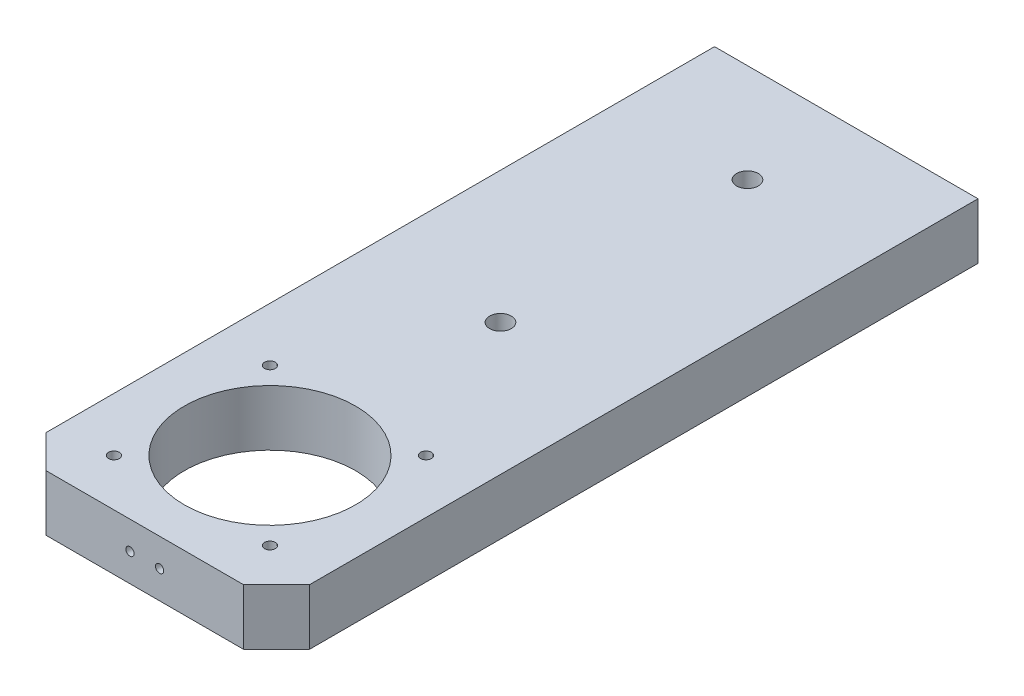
ISO-10303-21;
HEADER;
FILE_DESCRIPTION(('STEP AP214'),'2;1');
FILE_NAME('part.step','',(''),(''),'','','');
FILE_SCHEMA(('AUTOMOTIVE_DESIGN { 1 0 10303 214 1 1 1 1 }'));
ENDSEC;
DATA;
#1=APPLICATION_CONTEXT('core data for automotive mechanical design processes');
#2=APPLICATION_PROTOCOL_DEFINITION('international standard','automotive_design',2000,#1);
#3=PRODUCT_CONTEXT('',#1,'mechanical');
#4=PRODUCT('Part','Part','',(#3));
#5=PRODUCT_RELATED_PRODUCT_CATEGORY('part','',(#4));
#6=PRODUCT_DEFINITION_FORMATION('','',#4);
#7=PRODUCT_DEFINITION_CONTEXT('part definition',#1,'design');
#8=PRODUCT_DEFINITION('design','',#6,#7);
#9=PRODUCT_DEFINITION_SHAPE('','',#8);
#10=(LENGTH_UNIT() NAMED_UNIT(*) SI_UNIT(.MILLI.,.METRE.));
#11=(NAMED_UNIT(*) PLANE_ANGLE_UNIT() SI_UNIT($,.RADIAN.));
#12=(NAMED_UNIT(*) SI_UNIT($,.STERADIAN.) SOLID_ANGLE_UNIT());
#13=UNCERTAINTY_MEASURE_WITH_UNIT(LENGTH_MEASURE(1.E-05),#10,'distance_accuracy_value','');
#14=(GEOMETRIC_REPRESENTATION_CONTEXT(3) GLOBAL_UNCERTAINTY_ASSIGNED_CONTEXT((#13)) GLOBAL_UNIT_ASSIGNED_CONTEXT((#10,
#11,#12)) REPRESENTATION_CONTEXT('',''));
#15=CARTESIAN_POINT('',(0.,0.,0.));
#16=DIRECTION('',(0.,0.,1.));
#17=DIRECTION('',(1.,0.,0.));
#18=AXIS2_PLACEMENT_3D('',#15,#16,#17);
#19=CARTESIAN_POINT('',(-40.,-40.,213.));
#20=DIRECTION('',(1.,0.,0.));
#21=DIRECTION('',(0.,0.,-1.));
#22=AXIS2_PLACEMENT_3D('',#19,#20,#21);
#23=PLANE('',#22);
#24=DIRECTION('',(0.,0.,-1.));
#25=VECTOR('',#24,1.);
#26=CARTESIAN_POINT('',(-40.,-40.,213.));
#27=LINE('',#26,#25);
#28=CARTESIAN_POINT('',(-40.,-40.,203.));
#29=VERTEX_POINT('',#28);
#30=CARTESIAN_POINT('',(-40.,-40.,0.));
#31=VERTEX_POINT('',#30);
#32=EDGE_CURVE('E142',#29,#31,#27,.T.);
#33=ORIENTED_EDGE('',*,*,#32,.F.);
#34=DIRECTION('',(0.,1.,0.));
#35=VECTOR('',#34,1.);
#36=CARTESIAN_POINT('',(-40.,-40.,203.));
#37=LINE('',#36,#35);
#38=CARTESIAN_POINT('',(-40.,-23.,203.));
#39=VERTEX_POINT('',#38);
#40=EDGE_CURVE('E46',#29,#39,#37,.T.);
#41=ORIENTED_EDGE('',*,*,#40,.T.);
#42=DIRECTION('',(0.,0.,-1.));
#43=VECTOR('',#42,1.);
#44=CARTESIAN_POINT('',(-40.,-23.,213.));
#45=LINE('',#44,#43);
#46=CARTESIAN_POINT('',(-40.,-23.,0.));
#47=VERTEX_POINT('',#46);
#48=EDGE_CURVE('E126',#39,#47,#45,.T.);
#49=ORIENTED_EDGE('',*,*,#48,.T.);
#50=DIRECTION('',(0.,-1.,0.));
#51=VECTOR('',#50,1.);
#52=CARTESIAN_POINT('',(-40.,-40.,0.));
#53=LINE('',#52,#51);
#54=EDGE_CURVE('E116',#47,#31,#53,.T.);
#55=ORIENTED_EDGE('',*,*,#54,.T.);
#56=EDGE_LOOP('',(#33,#41,#49,#55));
#57=FACE_BOUND('',#56,.T.);
#58=ADVANCED_FACE('F16',(#57),#23,.F.);
#59=CARTESIAN_POINT('',(-40.,-40.,213.));
#60=DIRECTION('',(0.,1.,0.));
#61=DIRECTION('',(0.,0.,1.));
#62=AXIS2_PLACEMENT_3D('',#59,#60,#61);
#63=PLANE('',#62);
#64=CARTESIAN_POINT('',(0.,-40.,30.));
#65=DIRECTION('',(0.,-1.,0.));
#66=DIRECTION('',(0.,0.,-1.));
#67=AXIS2_PLACEMENT_3D('',#64,#65,#66);
#68=CIRCLE('',#67,5.525);
#69=CARTESIAN_POINT('',(0.,-40.,24.475));
#70=VERTEX_POINT('',#69);
#71=EDGE_CURVE('E162',#70,#70,#68,.T.);
#72=ORIENTED_EDGE('',*,*,#71,.F.);
#73=EDGE_LOOP('',(#72));
#74=FACE_BOUND('',#73,.T.);
#75=CARTESIAN_POINT('',(0.,-40.,105.));
#76=DIRECTION('',(0.,-1.,0.));
#77=DIRECTION('',(0.,0.,-1.));
#78=AXIS2_PLACEMENT_3D('',#75,#76,#77);
#79=CIRCLE('',#78,5.525);
#80=CARTESIAN_POINT('',(0.,-40.,99.475));
#81=VERTEX_POINT('',#80);
#82=EDGE_CURVE('E517',#81,#81,#79,.T.);
#83=ORIENTED_EDGE('',*,*,#82,.F.);
#84=EDGE_LOOP('',(#83));
#85=FACE_BOUND('',#84,.T.);
#86=CARTESIAN_POINT('',(-23.6880771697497,-40.,151.311922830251));
#87=DIRECTION('',(0.,1.,0.));
#88=DIRECTION('',(0.,0.,1.));
#89=AXIS2_PLACEMENT_3D('',#86,#87,#88);
#90=CIRCLE('',#89,1.65);
#91=CARTESIAN_POINT('',(-23.6880771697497,-40.,152.961922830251));
#92=VERTEX_POINT('',#91);
#93=EDGE_CURVE('E538',#92,#92,#90,.T.);
#94=ORIENTED_EDGE('',*,*,#93,.T.);
#95=EDGE_LOOP('',(#94));
#96=FACE_BOUND('',#95,.T.);
#97=CARTESIAN_POINT('',(23.6880771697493,-40.,151.31192283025));
#98=DIRECTION('',(0.,1.,0.));
#99=DIRECTION('',(0.,0.,1.));
#100=AXIS2_PLACEMENT_3D('',#97,#98,#99);
#101=CIRCLE('',#100,1.65);
#102=CARTESIAN_POINT('',(23.6880771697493,-40.,152.961922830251));
#103=VERTEX_POINT('',#102);
#104=EDGE_CURVE('E544',#103,#103,#101,.T.);
#105=ORIENTED_EDGE('',*,*,#104,.T.);
#106=EDGE_LOOP('',(#105));
#107=FACE_BOUND('',#106,.T.);
#108=CARTESIAN_POINT('',(23.6880771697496,-40.,198.688077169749));
#109=DIRECTION('',(0.,1.,0.));
#110=DIRECTION('',(0.,0.,1.));
#111=AXIS2_PLACEMENT_3D('',#108,#109,#110);
#112=CIRCLE('',#111,1.65);
#113=CARTESIAN_POINT('',(23.6880771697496,-40.,200.338077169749));
#114=VERTEX_POINT('',#113);
#115=EDGE_CURVE('E550',#114,#114,#112,.T.);
#116=ORIENTED_EDGE('',*,*,#115,.T.);
#117=EDGE_LOOP('',(#116));
#118=FACE_BOUND('',#117,.T.);
#119=CARTESIAN_POINT('',(-23.6880771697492,-40.,198.68807716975));
#120=DIRECTION('',(0.,1.,0.));
#121=DIRECTION('',(0.,0.,1.));
#122=AXIS2_PLACEMENT_3D('',#119,#120,#121);
#123=CIRCLE('',#122,1.65);
#124=CARTESIAN_POINT('',(-23.6880771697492,-40.,200.33807716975));
#125=VERTEX_POINT('',#124);
#126=EDGE_CURVE('E100',#125,#125,#123,.T.);
#127=ORIENTED_EDGE('',*,*,#126,.T.);
#128=EDGE_LOOP('',(#127));
#129=FACE_BOUND('',#128,.T.);
#130=CARTESIAN_POINT('',(0.,-40.,175.));
#131=DIRECTION('',(0.,-1.,0.));
#132=DIRECTION('',(0.,0.,-1.));
#133=AXIS2_PLACEMENT_3D('',#130,#131,#132);
#134=CIRCLE('',#133,26.);
#135=CARTESIAN_POINT('',(0.,-40.,149.));
#136=VERTEX_POINT('',#135);
#137=EDGE_CURVE('E112',#136,#136,#134,.T.);
#138=ORIENTED_EDGE('',*,*,#137,.F.);
#139=EDGE_LOOP('',(#138));
#140=FACE_BOUND('',#139,.T.);
#141=DIRECTION('',(1.,0.,0.));
#142=VECTOR('',#141,1.);
#143=CARTESIAN_POINT('',(-40.,-40.,213.));
#144=LINE('',#143,#142);
#145=CARTESIAN_POINT('',(-30.,-40.,213.));
#146=VERTEX_POINT('',#145);
#147=CARTESIAN_POINT('',(30.,-40.,213.));
#148=VERTEX_POINT('',#147);
#149=EDGE_CURVE('E119',#146,#148,#144,.T.);
#150=ORIENTED_EDGE('',*,*,#149,.F.);
#151=DIRECTION('',(0.707106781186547,0.,0.707106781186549));
#152=VECTOR('',#151,1.);
#153=CARTESIAN_POINT('',(-30.,-40.,213.));
#154=LINE('',#153,#152);
#155=EDGE_CURVE('E152',#146,#29,#154,.F.);
#156=ORIENTED_EDGE('',*,*,#155,.T.);
#157=ORIENTED_EDGE('',*,*,#32,.T.);
#158=DIRECTION('',(1.,0.,0.));
#159=VECTOR('',#158,1.);
#160=CARTESIAN_POINT('',(-40.,-40.,0.));
#161=LINE('',#160,#159);
#162=CARTESIAN_POINT('',(40.,-40.,0.));
#163=VERTEX_POINT('',#162);
#164=EDGE_CURVE('E129',#31,#163,#161,.T.);
#165=ORIENTED_EDGE('',*,*,#164,.T.);
#166=DIRECTION('',(0.,0.,-1.));
#167=VECTOR('',#166,1.);
#168=CARTESIAN_POINT('',(40.,-40.,213.));
#169=LINE('',#168,#167);
#170=CARTESIAN_POINT('',(40.,-40.,203.));
#171=VERTEX_POINT('',#170);
#172=EDGE_CURVE('E140',#171,#163,#169,.T.);
#173=ORIENTED_EDGE('',*,*,#172,.F.);
#174=DIRECTION('',(0.707106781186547,0.,-0.707106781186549));
#175=VECTOR('',#174,1.);
#176=CARTESIAN_POINT('',(30.,-40.,213.));
#177=LINE('',#176,#175);
#178=EDGE_CURVE('E150',#171,#148,#177,.F.);
#179=ORIENTED_EDGE('',*,*,#178,.T.);
#180=EDGE_LOOP('',(#150,#156,#157,#165,#173,#179));
#181=FACE_BOUND('',#180,.T.);
#182=ADVANCED_FACE('F256',(#74,#85,#96,#107,#118,#129,#140,#181),#63,.F.);
#183=CARTESIAN_POINT('',(40.,-40.,213.));
#184=DIRECTION('',(-1.,0.,0.));
#185=DIRECTION('',(0.,0.,1.));
#186=AXIS2_PLACEMENT_3D('',#183,#184,#185);
#187=PLANE('',#186);
#188=DIRECTION('',(0.,0.,-1.));
#189=VECTOR('',#188,1.);
#190=CARTESIAN_POINT('',(40.,-23.,213.));
#191=LINE('',#190,#189);
#192=CARTESIAN_POINT('',(40.,-23.,203.));
#193=VERTEX_POINT('',#192);
#194=CARTESIAN_POINT('',(40.,-23.,0.));
#195=VERTEX_POINT('',#194);
#196=EDGE_CURVE('E138',#193,#195,#191,.T.);
#197=ORIENTED_EDGE('',*,*,#196,.F.);
#198=DIRECTION('',(0.,-1.,0.));
#199=VECTOR('',#198,1.);
#200=CARTESIAN_POINT('',(40.,-40.,203.));
#201=LINE('',#200,#199);
#202=EDGE_CURVE('E11',#193,#171,#201,.T.);
#203=ORIENTED_EDGE('',*,*,#202,.T.);
#204=ORIENTED_EDGE('',*,*,#172,.T.);
#205=DIRECTION('',(0.,1.,0.));
#206=VECTOR('',#205,1.);
#207=CARTESIAN_POINT('',(40.,-40.,0.));
#208=LINE('',#207,#206);
#209=EDGE_CURVE('E132',#163,#195,#208,.T.);
#210=ORIENTED_EDGE('',*,*,#209,.T.);
#211=EDGE_LOOP('',(#197,#203,#204,#210));
#212=FACE_BOUND('',#211,.T.);
#213=ADVANCED_FACE('F262',(#212),#187,.F.);
#214=CARTESIAN_POINT('',(-40.,-23.,213.));
#215=DIRECTION('',(0.,-1.,0.));
#216=DIRECTION('',(0.,0.,-1.));
#217=AXIS2_PLACEMENT_3D('',#214,#215,#216);
#218=PLANE('',#217);
#219=CARTESIAN_POINT('',(0.,-23.,30.));
#220=DIRECTION('',(0.,-1.,0.));
#221=DIRECTION('',(0.,0.,-1.));
#222=AXIS2_PLACEMENT_3D('',#219,#220,#221);
#223=CIRCLE('',#222,3.3);
#224=CARTESIAN_POINT('',(0.,-23.,26.7));
#225=VERTEX_POINT('',#224);
#226=EDGE_CURVE('E514',#225,#225,#223,.T.);
#227=ORIENTED_EDGE('',*,*,#226,.T.);
#228=EDGE_LOOP('',(#227));
#229=FACE_BOUND('',#228,.T.);
#230=CARTESIAN_POINT('',(0.,-23.,105.));
#231=DIRECTION('',(0.,-1.,0.));
#232=DIRECTION('',(0.,0.,-1.));
#233=AXIS2_PLACEMENT_3D('',#230,#231,#232);
#234=CIRCLE('',#233,3.3);
#235=CARTESIAN_POINT('',(0.,-23.,101.7));
#236=VERTEX_POINT('',#235);
#237=EDGE_CURVE('E532',#236,#236,#234,.T.);
#238=ORIENTED_EDGE('',*,*,#237,.T.);
#239=EDGE_LOOP('',(#238));
#240=FACE_BOUND('',#239,.T.);
#241=CARTESIAN_POINT('',(-23.6880771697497,-23.,151.311922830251));
#242=DIRECTION('',(0.,1.,0.));
#243=DIRECTION('',(0.,0.,1.));
#244=AXIS2_PLACEMENT_3D('',#241,#242,#243);
#245=CIRCLE('',#244,1.65);
#246=CARTESIAN_POINT('',(-23.6880771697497,-23.,152.961922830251));
#247=VERTEX_POINT('',#246);
#248=EDGE_CURVE('E535',#247,#247,#245,.T.);
#249=ORIENTED_EDGE('',*,*,#248,.F.);
#250=EDGE_LOOP('',(#249));
#251=FACE_BOUND('',#250,.T.);
#252=CARTESIAN_POINT('',(23.6880771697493,-23.,151.31192283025));
#253=DIRECTION('',(0.,1.,0.));
#254=DIRECTION('',(0.,0.,1.));
#255=AXIS2_PLACEMENT_3D('',#252,#253,#254);
#256=CIRCLE('',#255,1.65);
#257=CARTESIAN_POINT('',(23.6880771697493,-23.,152.961922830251));
#258=VERTEX_POINT('',#257);
#259=EDGE_CURVE('E541',#258,#258,#256,.T.);
#260=ORIENTED_EDGE('',*,*,#259,.F.);
#261=EDGE_LOOP('',(#260));
#262=FACE_BOUND('',#261,.T.);
#263=CARTESIAN_POINT('',(23.6880771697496,-23.,198.688077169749));
#264=DIRECTION('',(0.,1.,0.));
#265=DIRECTION('',(0.,0.,1.));
#266=AXIS2_PLACEMENT_3D('',#263,#264,#265);
#267=CIRCLE('',#266,1.65);
#268=CARTESIAN_POINT('',(23.6880771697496,-23.,200.338077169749));
#269=VERTEX_POINT('',#268);
#270=EDGE_CURVE('E547',#269,#269,#267,.T.);
#271=ORIENTED_EDGE('',*,*,#270,.F.);
#272=EDGE_LOOP('',(#271));
#273=FACE_BOUND('',#272,.T.);
#274=CARTESIAN_POINT('',(-23.6880771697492,-23.,198.68807716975));
#275=DIRECTION('',(0.,1.,0.));
#276=DIRECTION('',(0.,0.,1.));
#277=AXIS2_PLACEMENT_3D('',#274,#275,#276);
#278=CIRCLE('',#277,1.65);
#279=CARTESIAN_POINT('',(-23.6880771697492,-23.,200.33807716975));
#280=VERTEX_POINT('',#279);
#281=EDGE_CURVE('E553',#280,#280,#278,.T.);
#282=ORIENTED_EDGE('',*,*,#281,.F.);
#283=EDGE_LOOP('',(#282));
#284=FACE_BOUND('',#283,.T.);
#285=CARTESIAN_POINT('',(0.,-23.,175.));
#286=DIRECTION('',(0.,-1.,0.));
#287=DIRECTION('',(0.,0.,-1.));
#288=AXIS2_PLACEMENT_3D('',#285,#286,#287);
#289=CIRCLE('',#288,26.);
#290=CARTESIAN_POINT('',(0.,-23.,149.));
#291=VERTEX_POINT('',#290);
#292=EDGE_CURVE('E113',#291,#291,#289,.T.);
#293=ORIENTED_EDGE('',*,*,#292,.T.);
#294=EDGE_LOOP('',(#293));
#295=FACE_BOUND('',#294,.T.);
#296=ORIENTED_EDGE('',*,*,#48,.F.);
#297=DIRECTION('',(-0.707106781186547,0.,-0.707106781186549));
#298=VECTOR('',#297,1.);
#299=CARTESIAN_POINT('',(-30.,-23.,213.));
#300=LINE('',#299,#298);
#301=CARTESIAN_POINT('',(-30.,-23.,213.));
#302=VERTEX_POINT('',#301);
#303=EDGE_CURVE('E30',#39,#302,#300,.F.);
#304=ORIENTED_EDGE('',*,*,#303,.T.);
#305=DIRECTION('',(-1.,0.,0.));
#306=VECTOR('',#305,1.);
#307=CARTESIAN_POINT('',(-40.,-23.,213.));
#308=LINE('',#307,#306);
#309=CARTESIAN_POINT('',(30.,-23.,213.));
#310=VERTEX_POINT('',#309);
#311=EDGE_CURVE('E122',#310,#302,#308,.T.);
#312=ORIENTED_EDGE('',*,*,#311,.F.);
#313=DIRECTION('',(-0.707106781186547,0.,0.707106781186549));
#314=VECTOR('',#313,1.);
#315=CARTESIAN_POINT('',(30.,-23.,213.));
#316=LINE('',#315,#314);
#317=EDGE_CURVE('E38',#310,#193,#316,.F.);
#318=ORIENTED_EDGE('',*,*,#317,.T.);
#319=ORIENTED_EDGE('',*,*,#196,.T.);
#320=DIRECTION('',(-1.,0.,0.));
#321=VECTOR('',#320,1.);
#322=CARTESIAN_POINT('',(-40.,-23.,0.));
#323=LINE('',#322,#321);
#324=EDGE_CURVE('E123',#195,#47,#323,.T.);
#325=ORIENTED_EDGE('',*,*,#324,.T.);
#326=EDGE_LOOP('',(#296,#304,#312,#318,#319,#325));
#327=FACE_BOUND('',#326,.T.);
#328=ADVANCED_FACE('F276',(#229,#240,#251,#262,#273,#284,#295,#327),#218,.F.);
#329=CARTESIAN_POINT('',(0.,0.,213.));
#330=DIRECTION('',(0.,0.,-1.));
#331=DIRECTION('',(-1.,0.,0.));
#332=AXIS2_PLACEMENT_3D('',#329,#330,#331);
#333=PLANE('',#332);
#334=CARTESIAN_POINT('',(-4.5,-31.5,213.));
#335=DIRECTION('',(0.,0.,1.));
#336=DIRECTION('',(1.,0.,0.));
#337=AXIS2_PLACEMENT_3D('',#334,#335,#336);
#338=CIRCLE('',#337,1.25);
#339=CARTESIAN_POINT('',(-3.25,-31.5,213.));
#340=VERTEX_POINT('',#339);
#341=EDGE_CURVE('E493',#340,#340,#338,.T.);
#342=ORIENTED_EDGE('',*,*,#341,.F.);
#343=EDGE_LOOP('',(#342));
#344=FACE_BOUND('',#343,.T.);
#345=CARTESIAN_POINT('',(4.5,-31.5,213.));
#346=DIRECTION('',(0.,0.,1.));
#347=DIRECTION('',(1.,0.,0.));
#348=AXIS2_PLACEMENT_3D('',#345,#346,#347);
#349=CIRCLE('',#348,1.25);
#350=CARTESIAN_POINT('',(5.75,-31.5,213.));
#351=VERTEX_POINT('',#350);
#352=EDGE_CURVE('E163',#351,#351,#349,.T.);
#353=ORIENTED_EDGE('',*,*,#352,.F.);
#354=EDGE_LOOP('',(#353));
#355=FACE_BOUND('',#354,.T.);
#356=ORIENTED_EDGE('',*,*,#311,.T.);
#357=DIRECTION('',(0.,-1.,0.));
#358=VECTOR('',#357,1.);
#359=CARTESIAN_POINT('',(-30.,0.,213.));
#360=LINE('',#359,#358);
#361=EDGE_CURVE('E147',#302,#146,#360,.T.);
#362=ORIENTED_EDGE('',*,*,#361,.T.);
#363=ORIENTED_EDGE('',*,*,#149,.T.);
#364=DIRECTION('',(0.,1.,0.));
#365=VECTOR('',#364,1.);
#366=CARTESIAN_POINT('',(30.,0.,213.));
#367=LINE('',#366,#365);
#368=EDGE_CURVE('E144',#148,#310,#367,.T.);
#369=ORIENTED_EDGE('',*,*,#368,.T.);
#370=EDGE_LOOP('',(#356,#362,#363,#369));
#371=FACE_BOUND('',#370,.T.);
#372=ADVANCED_FACE('F278',(#344,#355,#371),#333,.F.);
#373=CARTESIAN_POINT('',(0.,0.,0.));
#374=DIRECTION('',(0.,0.,-1.));
#375=DIRECTION('',(-1.,0.,0.));
#376=AXIS2_PLACEMENT_3D('',#373,#374,#375);
#377=PLANE('',#376);
#378=CARTESIAN_POINT('',(25.,-32.,0.));
#379=DIRECTION('',(0.,0.,-1.));
#380=DIRECTION('',(-1.,0.,0.));
#381=AXIS2_PLACEMENT_3D('',#378,#379,#380);
#382=CIRCLE('',#381,2.5);
#383=CARTESIAN_POINT('',(22.5,-32.,0.));
#384=VERTEX_POINT('',#383);
#385=EDGE_CURVE('E94',#384,#384,#382,.T.);
#386=ORIENTED_EDGE('',*,*,#385,.F.);
#387=EDGE_LOOP('',(#386));
#388=FACE_BOUND('',#387,.T.);
#389=CARTESIAN_POINT('',(0.,-32.,0.));
#390=DIRECTION('',(0.,0.,-1.));
#391=DIRECTION('',(-1.,0.,0.));
#392=AXIS2_PLACEMENT_3D('',#389,#390,#391);
#393=CIRCLE('',#392,2.5);
#394=CARTESIAN_POINT('',(-2.5,-32.,0.));
#395=VERTEX_POINT('',#394);
#396=EDGE_CURVE('E93',#395,#395,#393,.T.);
#397=ORIENTED_EDGE('',*,*,#396,.F.);
#398=EDGE_LOOP('',(#397));
#399=FACE_BOUND('',#398,.T.);
#400=CARTESIAN_POINT('',(-25.,-32.,0.));
#401=DIRECTION('',(0.,0.,-1.));
#402=DIRECTION('',(-1.,0.,0.));
#403=AXIS2_PLACEMENT_3D('',#400,#401,#402);
#404=CIRCLE('',#403,2.5);
#405=CARTESIAN_POINT('',(-27.5,-32.,0.));
#406=VERTEX_POINT('',#405);
#407=EDGE_CURVE('E106',#406,#406,#404,.T.);
#408=ORIENTED_EDGE('',*,*,#407,.F.);
#409=EDGE_LOOP('',(#408));
#410=FACE_BOUND('',#409,.T.);
#411=ORIENTED_EDGE('',*,*,#54,.F.);
#412=ORIENTED_EDGE('',*,*,#324,.F.);
#413=ORIENTED_EDGE('',*,*,#209,.F.);
#414=ORIENTED_EDGE('',*,*,#164,.F.);
#415=EDGE_LOOP('',(#411,#412,#413,#414));
#416=FACE_BOUND('',#415,.T.);
#417=ADVANCED_FACE('F272',(#388,#399,#410,#416),#377,.T.);
#418=CARTESIAN_POINT('',(0.,-23.,175.));
#419=DIRECTION('',(0.,-1.,0.));
#420=DIRECTION('',(0.,0.,-1.));
#421=AXIS2_PLACEMENT_3D('',#418,#419,#420);
#422=CYLINDRICAL_SURFACE('',#421,26.);
#423=CARTESIAN_POINT('',(-3.25,-31.5,200.79607528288));
#424=CARTESIAN_POINT('',(-3.25000312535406,-31.4302395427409,200.79607514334));
#425=CARTESIAN_POINT('',(-3.25586006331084,-31.3604292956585,200.795339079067));
#426=CARTESIAN_POINT('',(-3.27913481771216,-31.2227376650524,200.792390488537));
#427=CARTESIAN_POINT('',(-3.29656629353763,-31.1548586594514,200.790176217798));
#428=CARTESIAN_POINT('',(-3.34246714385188,-31.0230483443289,200.78426740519));
#429=CARTESIAN_POINT('',(-3.37093007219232,-30.9591147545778,200.780573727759));
#430=CARTESIAN_POINT('',(-3.43804252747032,-30.836975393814,200.771709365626));
#431=CARTESIAN_POINT('',(-3.47668961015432,-30.7787682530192,200.766539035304));
#432=CARTESIAN_POINT('',(-3.5631499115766,-30.6695323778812,200.7547251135));
#433=CARTESIAN_POINT('',(-3.61098722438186,-30.618523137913,200.74807764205));
#434=CARTESIAN_POINT('',(-3.71436053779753,-30.5252603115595,200.733368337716));
#435=CARTESIAN_POINT('',(-3.76989704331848,-30.4830072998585,200.725306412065));
#436=CARTESIAN_POINT('',(-3.88750305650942,-30.4081006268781,200.707797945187));
#437=CARTESIAN_POINT('',(-3.94961840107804,-30.3755212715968,200.698341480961));
#438=CARTESIAN_POINT('',(-4.07824846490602,-30.3212294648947,200.678242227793));
#439=CARTESIAN_POINT('',(-4.14476342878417,-30.2995176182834,200.667599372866));
#440=CARTESIAN_POINT('',(-4.28109915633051,-30.2673019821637,200.645214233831));
#441=CARTESIAN_POINT('',(-4.35094900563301,-30.2569290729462,200.63346077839));
#442=CARTESIAN_POINT('',(-4.49127734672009,-30.2480543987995,200.609246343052));
#443=CARTESIAN_POINT('',(-4.5617558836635,-30.2495534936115,200.596785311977));
#444=CARTESIAN_POINT('',(-4.7022394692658,-30.2644241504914,200.571353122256));
#445=CARTESIAN_POINT('',(-4.77222871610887,-30.2779378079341,200.558377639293));
#446=CARTESIAN_POINT('',(-4.90891344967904,-30.3166421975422,200.532477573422));
#447=CARTESIAN_POINT('',(-4.97560875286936,-30.3418335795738,200.519552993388));
#448=CARTESIAN_POINT('',(-5.1041879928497,-30.4033850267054,200.494148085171));
#449=CARTESIAN_POINT('',(-5.16604379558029,-30.4398050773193,200.481670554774));
#450=CARTESIAN_POINT('',(-5.28275096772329,-30.5227961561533,200.457731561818));
#451=CARTESIAN_POINT('',(-5.33760249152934,-30.5693669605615,200.446270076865));
#452=CARTESIAN_POINT('',(-5.43825373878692,-30.6709924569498,200.424948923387));
#453=CARTESIAN_POINT('',(-5.48412221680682,-30.7259764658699,200.415077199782));
#454=CARTESIAN_POINT('',(-5.56592287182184,-30.8431793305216,200.397288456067));
#455=CARTESIAN_POINT('',(-5.60185623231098,-30.9053973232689,200.389371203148));
#456=CARTESIAN_POINT('',(-5.66199421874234,-31.0339503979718,200.376027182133));
#457=CARTESIAN_POINT('',(-5.68642322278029,-31.1001755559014,200.370552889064));
#458=CARTESIAN_POINT('',(-5.72381683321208,-31.2359397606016,200.362142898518));
#459=CARTESIAN_POINT('',(-5.73678303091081,-31.3054783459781,200.359206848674));
#460=CARTESIAN_POINT('',(-5.75066799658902,-31.4443427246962,200.356061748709));
#461=CARTESIAN_POINT('',(-5.75183171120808,-31.5136428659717,200.355797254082));
#462=CARTESIAN_POINT('',(-5.74271164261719,-31.6514433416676,200.357864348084));
#463=CARTESIAN_POINT('',(-5.7324285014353,-31.719943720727,200.360195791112));
#464=CARTESIAN_POINT('',(-5.7008580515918,-31.8537432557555,200.367311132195));
#465=CARTESIAN_POINT('',(-5.67964360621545,-31.9190605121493,200.372078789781));
#466=CARTESIAN_POINT('',(-5.62692015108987,-32.0451820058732,200.383823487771));
#467=CARTESIAN_POINT('',(-5.595410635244,-32.1059860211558,200.390800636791));
#468=CARTESIAN_POINT('',(-5.52260587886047,-32.2221731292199,200.406735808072));
#469=CARTESIAN_POINT('',(-5.48119672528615,-32.2774816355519,200.415716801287));
#470=CARTESIAN_POINT('',(-5.39001599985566,-32.380397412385,200.435209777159));
#471=CARTESIAN_POINT('',(-5.34024349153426,-32.4280038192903,200.445721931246));
#472=CARTESIAN_POINT('',(-5.23254631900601,-32.5152754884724,200.468088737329));
#473=CARTESIAN_POINT('',(-5.17446618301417,-32.5547426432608,200.479967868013));
#474=CARTESIAN_POINT('',(-5.05263941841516,-32.6233785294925,200.504405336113));
#475=CARTESIAN_POINT('',(-4.98889220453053,-32.6525461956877,200.51696374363));
#476=CARTESIAN_POINT('',(-4.856291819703,-32.7002533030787,200.542534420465));
#477=CARTESIAN_POINT('',(-4.78736794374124,-32.7185942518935,200.555550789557));
#478=CARTESIAN_POINT('',(-4.64736838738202,-32.7433164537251,200.581380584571));
#479=CARTESIAN_POINT('',(-4.57629261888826,-32.7496972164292,200.594194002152));
#480=CARTESIAN_POINT('',(-4.43365989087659,-32.7502829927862,200.619288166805));
#481=CARTESIAN_POINT('',(-4.36210221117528,-32.7444326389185,200.631566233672));
#482=CARTESIAN_POINT('',(-4.22089191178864,-32.7205432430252,200.655198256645));
#483=CARTESIAN_POINT('',(-4.15123923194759,-32.702504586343,200.666552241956));
#484=CARTESIAN_POINT('',(-4.01641204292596,-32.6548659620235,200.687994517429));
#485=CARTESIAN_POINT('',(-3.95120728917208,-32.6253557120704,200.698091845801));
#486=CARTESIAN_POINT('',(-3.82663995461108,-32.5555483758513,200.716936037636));
#487=CARTESIAN_POINT('',(-3.76727676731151,-32.5152524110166,200.725683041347));
#488=CARTESIAN_POINT('',(-3.65689208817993,-32.4255610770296,200.74160479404));
#489=CARTESIAN_POINT('',(-3.60577510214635,-32.376286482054,200.7487979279));
#490=CARTESIAN_POINT('',(-3.51252072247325,-32.2696750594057,200.761685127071));
#491=CARTESIAN_POINT('',(-3.47038501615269,-32.2123367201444,200.767378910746));
#492=CARTESIAN_POINT('',(-3.39677004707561,-32.0918768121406,200.777186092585));
#493=CARTESIAN_POINT('',(-3.36518693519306,-32.0288198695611,200.781314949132));
#494=CARTESIAN_POINT('',(-3.3130706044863,-31.8982788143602,200.788064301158));
#495=CARTESIAN_POINT('',(-3.29252379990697,-31.8308002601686,200.790686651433));
#496=CARTESIAN_POINT('',(-3.26855786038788,-31.7190722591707,200.7937319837));
#497=CARTESIAN_POINT('',(-3.26160784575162,-31.6755604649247,200.794610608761));
#498=CARTESIAN_POINT('',(-3.25232793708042,-31.5880390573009,200.795782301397));
#499=CARTESIAN_POINT('',(-3.24999802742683,-31.5440294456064,200.796075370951));
#500=CARTESIAN_POINT('',(-3.25,-31.5,200.79607528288));
#501=B_SPLINE_CURVE_WITH_KNOTS('',3,(#423,#424,#425,#426,#427,#428,#429,#430,#431,#432,#433,
#434,#435,#436,#437,#438,#439,#440,#441,#442,#443,#444,#445,#446,#447,#448,#449,#450,#451,#452,
#453,#454,#455,#456,#457,#458,#459,#460,#461,#462,#463,#464,#465,#466,#467,#468,#469,#470,#471,
#472,#473,#474,#475,#476,#477,#478,#479,#480,#481,#482,#483,#484,#485,#486,#487,#488,#489,#490,
#491,#492,#493,#494,#495,#496,#497,#498,#499,#500),.UNSPECIFIED.,.T.,.F.,(4,2,2,2,2,2,2,2,2,2,2,
2,2,2,2,2,2,2,2,2,2,2,2,2,2,2,2,2,2,2,2,2,2,2,2,2,2,2,4),(0.,0.209120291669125,0.41848781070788,
0.627733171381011,0.836928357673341,1.04667966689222,1.25644473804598,1.46778169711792,
1.67913041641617,1.89289368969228,2.10667244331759,2.3230136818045,2.53936696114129,
2.75689667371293,2.97442159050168,3.19021028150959,3.40597325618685,3.61733327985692,
3.82866395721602,4.035599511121,4.24252345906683,4.4480856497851,4.65365794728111,
4.86172038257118,5.0698061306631,5.28247724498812,5.49517034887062,5.71165063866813,
5.92813980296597,6.14561108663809,6.36307549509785,6.57887229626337,6.79464666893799,
7.00770816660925,7.22080965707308,7.43174757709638,7.64242523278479,7.77441234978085,
7.90639902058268),.UNSPECIFIED.);
#502=CARTESIAN_POINT('',(-3.25,-31.5,200.79607528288));
#503=VERTEX_POINT('',#502);
#504=EDGE_CURVE('E20',#503,#503,#501,.T.);
#505=ORIENTED_EDGE('',*,*,#504,.T.);
#506=EDGE_LOOP('',(#505));
#507=FACE_BOUND('',#506,.T.);
#508=CARTESIAN_POINT('',(5.75,-31.5,200.356212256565));
#509=CARTESIAN_POINT('',(5.74999674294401,-31.430995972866,200.356213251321));
#510=CARTESIAN_POINT('',(5.74426456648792,-31.3619420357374,200.357514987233));
#511=CARTESIAN_POINT('',(5.72150386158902,-31.2257642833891,200.362660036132));
#512=CARTESIAN_POINT('',(5.70446185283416,-31.1586428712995,200.366506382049));
#513=CARTESIAN_POINT('',(5.65964841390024,-31.0283487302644,200.376542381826));
#514=CARTESIAN_POINT('',(5.63188848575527,-30.9651718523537,200.382729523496));
#515=CARTESIAN_POINT('',(5.566507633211,-30.8444271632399,200.397147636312));
#516=CARTESIAN_POINT('',(5.52888848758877,-30.7868583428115,200.405378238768));
#517=CARTESIAN_POINT('',(5.4443822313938,-30.6781487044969,200.423622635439));
#518=CARTESIAN_POINT('',(5.39738726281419,-30.6270952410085,200.433657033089));
#519=CARTESIAN_POINT('',(5.29577656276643,-30.5335580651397,200.455008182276));
#520=CARTESIAN_POINT('',(5.24115974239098,-30.4910755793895,200.466325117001));
#521=CARTESIAN_POINT('',(5.12452177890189,-30.4149052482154,200.490054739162));
#522=CARTESIAN_POINT('',(5.06236305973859,-30.3814338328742,200.50248618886));
#523=CARTESIAN_POINT('',(4.93337578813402,-30.3254233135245,200.527751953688));
#524=CARTESIAN_POINT('',(4.86654681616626,-30.3028851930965,200.540586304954));
#525=CARTESIAN_POINT('',(4.72907114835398,-30.2691032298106,200.566400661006));
#526=CARTESIAN_POINT('',(4.65838364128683,-30.2580247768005,200.57938013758));
#527=CARTESIAN_POINT('',(4.51607212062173,-30.24806961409,200.604888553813));
#528=CARTESIAN_POINT('',(4.44444809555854,-30.2491930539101,200.617417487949));
#529=CARTESIAN_POINT('',(4.30228736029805,-30.2636686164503,200.641675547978));
#530=CARTESIAN_POINT('',(4.23175090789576,-30.277023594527,200.653404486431));
#531=CARTESIAN_POINT('',(4.09384050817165,-30.3156598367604,200.675773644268));
#532=CARTESIAN_POINT('',(4.02646641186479,-30.3409405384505,200.686413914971));
#533=CARTESIAN_POINT('',(3.89754288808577,-30.4024592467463,200.706290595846));
#534=CARTESIAN_POINT('',(3.83594177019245,-30.4385846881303,200.715540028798));
#535=CARTESIAN_POINT('',(3.71965465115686,-30.5209010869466,200.732617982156));
#536=CARTESIAN_POINT('',(3.66496818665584,-30.567091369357,200.740446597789));
#537=CARTESIAN_POINT('',(3.56480391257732,-30.6676058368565,200.754508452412));
#538=CARTESIAN_POINT('',(3.5192201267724,-30.7218218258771,200.76076030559));
#539=CARTESIAN_POINT('',(3.43779585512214,-30.8372700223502,200.771753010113));
#540=CARTESIAN_POINT('',(3.40195485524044,-30.8985018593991,200.776493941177));
#541=CARTESIAN_POINT('',(3.34139087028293,-31.0256208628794,200.784414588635));
#542=CARTESIAN_POINT('',(3.31656674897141,-31.0914589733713,200.787608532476));
#543=CARTESIAN_POINT('',(3.27829210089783,-31.2264149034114,200.792502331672));
#544=CARTESIAN_POINT('',(3.2648412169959,-31.2955326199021,200.794202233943));
#545=CARTESIAN_POINT('',(3.24975468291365,-31.4347145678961,200.796107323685));
#546=CARTESIAN_POINT('',(3.24806023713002,-31.5047723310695,200.79631994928));
#547=CARTESIAN_POINT('',(3.25638090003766,-31.6441771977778,200.79527089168));
#548=CARTESIAN_POINT('',(3.26639584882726,-31.7135243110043,200.794009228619));
#549=CARTESIAN_POINT('',(3.29781739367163,-31.8494524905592,200.790010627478));
#550=CARTESIAN_POINT('',(3.31920997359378,-31.9160368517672,200.787275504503));
#551=CARTESIAN_POINT('',(3.3727433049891,-32.0446505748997,200.780328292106));
#552=CARTESIAN_POINT('',(3.40488407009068,-32.1066799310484,200.776116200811));
#553=CARTESIAN_POINT('',(3.47904634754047,-32.2245787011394,200.766211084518));
#554=CARTESIAN_POINT('',(3.52108940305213,-32.2804342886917,200.760514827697));
#555=CARTESIAN_POINT('',(3.61377991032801,-32.3842841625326,200.747675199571));
#556=CARTESIAN_POINT('',(3.66442754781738,-32.4322782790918,200.740531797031));
#557=CARTESIAN_POINT('',(3.77318591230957,-32.5193744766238,200.72481485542));
#558=CARTESIAN_POINT('',(3.83134036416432,-32.5584204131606,200.716232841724));
#559=CARTESIAN_POINT('',(3.95318353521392,-32.6262117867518,200.69778458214));
#560=CARTESIAN_POINT('',(4.0168725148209,-32.6549567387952,200.687918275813));
#561=CARTESIAN_POINT('',(4.14865648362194,-32.7016634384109,200.666965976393));
#562=CARTESIAN_POINT('',(4.21679018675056,-32.7195107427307,200.655868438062));
#563=CARTESIAN_POINT('',(4.35493756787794,-32.7435326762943,200.63278024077));
#564=CARTESIAN_POINT('',(4.42495138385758,-32.7497064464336,200.620789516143));
#565=CARTESIAN_POINT('',(4.56579430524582,-32.7502765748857,200.596067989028));
#566=CARTESIAN_POINT('',(4.63662272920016,-32.7445256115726,200.583329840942));
#567=CARTESIAN_POINT('',(4.77625166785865,-32.721145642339,200.55763021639));
#568=CARTESIAN_POINT('',(4.84505204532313,-32.7035158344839,200.544668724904));
#569=CARTESIAN_POINT('',(4.97928781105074,-32.6566672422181,200.518844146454));
#570=CARTESIAN_POINT('',(5.04468972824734,-32.6273514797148,200.505982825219));
#571=CARTESIAN_POINT('',(5.16963377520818,-32.5579215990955,200.48095271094));
#572=CARTESIAN_POINT('',(5.22917606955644,-32.5178077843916,200.468783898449));
#573=CARTESIAN_POINT('',(5.34048096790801,-32.428002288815,200.445677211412));
#574=CARTESIAN_POINT('',(5.39226877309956,-32.378342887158,200.434735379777));
#575=CARTESIAN_POINT('',(5.48674312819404,-32.2706914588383,200.414523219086));
#576=CARTESIAN_POINT('',(5.52942822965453,-32.2126981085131,200.405253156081));
#577=CARTESIAN_POINT('',(5.60369417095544,-32.0910619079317,200.388974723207));
#578=CARTESIAN_POINT('',(5.63544895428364,-32.0275298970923,200.38193108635));
#579=CARTESIAN_POINT('',(5.68776724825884,-31.8958695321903,200.370258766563));
#580=CARTESIAN_POINT('',(5.70834620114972,-31.827747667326,200.365626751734));
#581=CARTESIAN_POINT('',(5.7319705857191,-31.715948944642,200.360295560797));
#582=CARTESIAN_POINT('',(5.73872187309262,-31.6730590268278,200.358767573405));
#583=CARTESIAN_POINT('',(5.74773757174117,-31.5867859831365,200.356725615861));
#584=CARTESIAN_POINT('',(5.75000204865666,-31.5434028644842,200.356211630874));
#585=CARTESIAN_POINT('',(5.75,-31.5,200.356212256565));
#586=B_SPLINE_CURVE_WITH_KNOTS('',3,(#508,#509,#510,#511,#512,#513,#514,#515,#516,#517,#518,
#519,#520,#521,#522,#523,#524,#525,#526,#527,#528,#529,#530,#531,#532,#533,#534,#535,#536,#537,
#538,#539,#540,#541,#542,#543,#544,#545,#546,#547,#548,#549,#550,#551,#552,#553,#554,#555,#556,
#557,#558,#559,#560,#561,#562,#563,#564,#565,#566,#567,#568,#569,#570,#571,#572,#573,#574,#575,
#576,#577,#578,#579,#580,#581,#582,#583,#584,#585),.UNSPECIFIED.,.T.,.F.,(4,2,2,2,2,2,2,2,2,2,2,
2,2,2,2,2,2,2,2,2,2,2,2,2,2,2,2,2,2,2,2,2,2,2,2,2,2,2,4),(0.,0.206851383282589,
0.413949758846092,0.620826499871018,0.827665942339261,1.03703844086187,1.24644088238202,
1.4604969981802,1.67457236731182,1.89169597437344,2.10882224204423,2.32599920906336,
2.54316593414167,2.7581522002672,2.97312405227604,3.18542484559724,3.39771443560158,
3.60801269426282,3.81830434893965,4.02754354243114,4.23677987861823,4.44575905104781,
4.65473848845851,4.86417684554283,5.07361972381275,5.2843427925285,5.49507578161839,
5.70798537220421,5.92091063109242,6.13648209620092,6.35206811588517,6.56948175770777,
6.78688929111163,7.00357418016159,7.22029352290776,7.43338454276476,7.64618036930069,
7.77628978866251,7.90639730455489),.UNSPECIFIED.);
#587=CARTESIAN_POINT('',(5.75,-31.5,200.356212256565));
#588=VERTEX_POINT('',#587);
#589=EDGE_CURVE('E156',#588,#588,#586,.T.);
#590=ORIENTED_EDGE('',*,*,#589,.T.);
#591=EDGE_LOOP('',(#590));
#592=FACE_BOUND('',#591,.T.);
#593=ORIENTED_EDGE('',*,*,#292,.F.);
#594=EDGE_LOOP('',(#593));
#595=FACE_BOUND('',#594,.T.);
#596=ORIENTED_EDGE('',*,*,#137,.T.);
#597=EDGE_LOOP('',(#596));
#598=FACE_BOUND('',#597,.T.);
#599=ADVANCED_FACE('F164',(#507,#592,#595,#598),#422,.F.);
#600=CARTESIAN_POINT('',(-30.,0.,213.));
#601=DIRECTION('',(0.707106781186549,0.,-0.707106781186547));
#602=DIRECTION('',(0.,-1.,0.));
#603=AXIS2_PLACEMENT_3D('',#600,#601,#602);
#604=PLANE('',#603);
#605=ORIENTED_EDGE('',*,*,#303,.F.);
#606=ORIENTED_EDGE('',*,*,#40,.F.);
#607=ORIENTED_EDGE('',*,*,#155,.F.);
#608=ORIENTED_EDGE('',*,*,#361,.F.);
#609=EDGE_LOOP('',(#605,#606,#607,#608));
#610=FACE_BOUND('',#609,.T.);
#611=ADVANCED_FACE('F252',(#610),#604,.F.);
#612=CARTESIAN_POINT('',(30.,0.,213.));
#613=DIRECTION('',(-0.707106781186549,0.,-0.707106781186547));
#614=DIRECTION('',(0.,1.,0.));
#615=AXIS2_PLACEMENT_3D('',#612,#613,#614);
#616=PLANE('',#615);
#617=ORIENTED_EDGE('',*,*,#178,.F.);
#618=ORIENTED_EDGE('',*,*,#202,.F.);
#619=ORIENTED_EDGE('',*,*,#317,.F.);
#620=ORIENTED_EDGE('',*,*,#368,.F.);
#621=EDGE_LOOP('',(#617,#618,#619,#620));
#622=FACE_BOUND('',#621,.T.);
#623=ADVANCED_FACE('F18',(#622),#616,.F.);
#624=CARTESIAN_POINT('',(-25.,-32.,17.));
#625=DIRECTION('',(0.,0.,-1.));
#626=DIRECTION('',(-1.,0.,0.));
#627=AXIS2_PLACEMENT_3D('',#624,#625,#626);
#628=CONICAL_SURFACE('',#627,2.5,1.02974425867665);
#629=CARTESIAN_POINT('',(-25.,-32.,18.5021515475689));
#630=VERTEX_POINT('',#629);
#631=VERTEX_LOOP('',#630);
#632=FACE_BOUND('',#631,.T.);
#633=CARTESIAN_POINT('',(-25.,-32.,17.));
#634=DIRECTION('',(0.,0.,-1.));
#635=DIRECTION('',(-1.,0.,0.));
#636=AXIS2_PLACEMENT_3D('',#633,#634,#635);
#637=CIRCLE('',#636,2.5);
#638=CARTESIAN_POINT('',(-27.5,-32.,17.));
#639=VERTEX_POINT('',#638);
#640=EDGE_CURVE('E109',#639,#639,#637,.T.);
#641=ORIENTED_EDGE('',*,*,#640,.T.);
#642=EDGE_LOOP('',(#641));
#643=FACE_BOUND('',#642,.T.);
#644=ADVANCED_FACE('F242',(#632,#643),#628,.F.);
#645=CARTESIAN_POINT('',(-25.,-32.,0.));
#646=DIRECTION('',(0.,0.,-1.));
#647=DIRECTION('',(-1.,0.,0.));
#648=AXIS2_PLACEMENT_3D('',#645,#646,#647);
#649=CYLINDRICAL_SURFACE('',#648,2.5);
#650=ORIENTED_EDGE('',*,*,#640,.F.);
#651=EDGE_LOOP('',(#650));
#652=FACE_BOUND('',#651,.T.);
#653=ORIENTED_EDGE('',*,*,#407,.T.);
#654=EDGE_LOOP('',(#653));
#655=FACE_BOUND('',#654,.T.);
#656=ADVANCED_FACE('F239',(#652,#655),#649,.F.);
#657=CARTESIAN_POINT('',(0.,-32.,17.));
#658=DIRECTION('',(0.,0.,-1.));
#659=DIRECTION('',(-1.,0.,0.));
#660=AXIS2_PLACEMENT_3D('',#657,#658,#659);
#661=CONICAL_SURFACE('',#660,2.5,1.02974425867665);
#662=CARTESIAN_POINT('',(0.,-32.,18.5021515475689));
#663=VERTEX_POINT('',#662);
#664=VERTEX_LOOP('',#663);
#665=FACE_BOUND('',#664,.T.);
#666=CARTESIAN_POINT('',(0.,-32.,17.));
#667=DIRECTION('',(0.,0.,-1.));
#668=DIRECTION('',(-1.,0.,0.));
#669=AXIS2_PLACEMENT_3D('',#666,#667,#668);
#670=CIRCLE('',#669,2.5);
#671=CARTESIAN_POINT('',(-2.5,-32.,17.));
#672=VERTEX_POINT('',#671);
#673=EDGE_CURVE('E97',#672,#672,#670,.T.);
#674=ORIENTED_EDGE('',*,*,#673,.T.);
#675=EDGE_LOOP('',(#674));
#676=FACE_BOUND('',#675,.T.);
#677=ADVANCED_FACE('F235',(#665,#676),#661,.F.);
#678=CARTESIAN_POINT('',(0.,-32.,0.));
#679=DIRECTION('',(0.,0.,-1.));
#680=DIRECTION('',(-1.,0.,0.));
#681=AXIS2_PLACEMENT_3D('',#678,#679,#680);
#682=CYLINDRICAL_SURFACE('',#681,2.5);
#683=ORIENTED_EDGE('',*,*,#673,.F.);
#684=EDGE_LOOP('',(#683));
#685=FACE_BOUND('',#684,.T.);
#686=ORIENTED_EDGE('',*,*,#396,.T.);
#687=EDGE_LOOP('',(#686));
#688=FACE_BOUND('',#687,.T.);
#689=ADVANCED_FACE('F87',(#685,#688),#682,.F.);
#690=CARTESIAN_POINT('',(25.,-32.,17.));
#691=DIRECTION('',(0.,0.,-1.));
#692=DIRECTION('',(-1.,0.,0.));
#693=AXIS2_PLACEMENT_3D('',#690,#691,#692);
#694=CONICAL_SURFACE('',#693,2.5,1.02974425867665);
#695=CARTESIAN_POINT('',(25.,-32.,18.5021515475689));
#696=VERTEX_POINT('',#695);
#697=VERTEX_LOOP('',#696);
#698=FACE_BOUND('',#697,.T.);
#699=CARTESIAN_POINT('',(25.,-32.,17.));
#700=DIRECTION('',(0.,0.,-1.));
#701=DIRECTION('',(-1.,0.,0.));
#702=AXIS2_PLACEMENT_3D('',#699,#700,#701);
#703=CIRCLE('',#702,2.5);
#704=CARTESIAN_POINT('',(22.5,-32.,17.));
#705=VERTEX_POINT('',#704);
#706=EDGE_CURVE('E91',#705,#705,#703,.T.);
#707=ORIENTED_EDGE('',*,*,#706,.T.);
#708=EDGE_LOOP('',(#707));
#709=FACE_BOUND('',#708,.T.);
#710=ADVANCED_FACE('F83',(#698,#709),#694,.F.);
#711=CARTESIAN_POINT('',(25.,-32.,0.));
#712=DIRECTION('',(0.,0.,-1.));
#713=DIRECTION('',(-1.,0.,0.));
#714=AXIS2_PLACEMENT_3D('',#711,#712,#713);
#715=CYLINDRICAL_SURFACE('',#714,2.5);
#716=ORIENTED_EDGE('',*,*,#706,.F.);
#717=EDGE_LOOP('',(#716));
#718=FACE_BOUND('',#717,.T.);
#719=ORIENTED_EDGE('',*,*,#385,.T.);
#720=EDGE_LOOP('',(#719));
#721=FACE_BOUND('',#720,.T.);
#722=ADVANCED_FACE('F86',(#718,#721),#715,.F.);
#723=CARTESIAN_POINT('',(-23.6880771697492,-23.,198.68807716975));
#724=DIRECTION('',(0.,1.,0.));
#725=DIRECTION('',(0.,0.,1.));
#726=AXIS2_PLACEMENT_3D('',#723,#724,#725);
#727=CYLINDRICAL_SURFACE('',#726,1.65);
#728=ORIENTED_EDGE('',*,*,#126,.F.);
#729=EDGE_LOOP('',(#728));
#730=FACE_BOUND('',#729,.T.);
#731=ORIENTED_EDGE('',*,*,#281,.T.);
#732=EDGE_LOOP('',(#731));
#733=FACE_BOUND('',#732,.T.);
#734=ADVANCED_FACE('F226',(#730,#733),#727,.F.);
#735=CARTESIAN_POINT('',(23.6880771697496,-23.,198.688077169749));
#736=DIRECTION('',(0.,1.,0.));
#737=DIRECTION('',(0.,0.,1.));
#738=AXIS2_PLACEMENT_3D('',#735,#736,#737);
#739=CYLINDRICAL_SURFACE('',#738,1.65);
#740=ORIENTED_EDGE('',*,*,#115,.F.);
#741=EDGE_LOOP('',(#740));
#742=FACE_BOUND('',#741,.T.);
#743=ORIENTED_EDGE('',*,*,#270,.T.);
#744=EDGE_LOOP('',(#743));
#745=FACE_BOUND('',#744,.T.);
#746=ADVANCED_FACE('F222',(#742,#745),#739,.F.);
#747=CARTESIAN_POINT('',(23.6880771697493,-23.,151.31192283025));
#748=DIRECTION('',(0.,1.,0.));
#749=DIRECTION('',(0.,0.,1.));
#750=AXIS2_PLACEMENT_3D('',#747,#748,#749);
#751=CYLINDRICAL_SURFACE('',#750,1.65);
#752=ORIENTED_EDGE('',*,*,#104,.F.);
#753=EDGE_LOOP('',(#752));
#754=FACE_BOUND('',#753,.T.);
#755=ORIENTED_EDGE('',*,*,#259,.T.);
#756=EDGE_LOOP('',(#755));
#757=FACE_BOUND('',#756,.T.);
#758=ADVANCED_FACE('F218',(#754,#757),#751,.F.);
#759=CARTESIAN_POINT('',(-23.6880771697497,-23.,151.311922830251));
#760=DIRECTION('',(0.,1.,0.));
#761=DIRECTION('',(0.,0.,1.));
#762=AXIS2_PLACEMENT_3D('',#759,#760,#761);
#763=CYLINDRICAL_SURFACE('',#762,1.65);
#764=ORIENTED_EDGE('',*,*,#93,.F.);
#765=EDGE_LOOP('',(#764));
#766=FACE_BOUND('',#765,.T.);
#767=ORIENTED_EDGE('',*,*,#248,.T.);
#768=EDGE_LOOP('',(#767));
#769=FACE_BOUND('',#768,.T.);
#770=ADVANCED_FACE('F214',(#766,#769),#763,.F.);
#771=CARTESIAN_POINT('',(0.,-40.,105.));
#772=DIRECTION('',(0.,-1.,0.));
#773=DIRECTION('',(0.,0.,-1.));
#774=AXIS2_PLACEMENT_3D('',#771,#772,#773);
#775=CYLINDRICAL_SURFACE('',#774,3.3);
#776=ORIENTED_EDGE('',*,*,#237,.F.);
#777=EDGE_LOOP('',(#776));
#778=FACE_BOUND('',#777,.T.);
#779=CARTESIAN_POINT('',(0.,-33.175,105.));
#780=DIRECTION('',(0.,-1.,0.));
#781=DIRECTION('',(0.,0.,-1.));
#782=AXIS2_PLACEMENT_3D('',#779,#780,#781);
#783=CIRCLE('',#782,3.3);
#784=CARTESIAN_POINT('',(0.,-33.175,101.7));
#785=VERTEX_POINT('',#784);
#786=EDGE_CURVE('E529',#785,#785,#783,.T.);
#787=ORIENTED_EDGE('',*,*,#786,.T.);
#788=EDGE_LOOP('',(#787));
#789=FACE_BOUND('',#788,.T.);
#790=ADVANCED_FACE('F210',(#778,#789),#775,.F.);
#791=CARTESIAN_POINT('',(0.,-33.2,105.));
#792=DIRECTION('',(0.,-1.,0.));
#793=DIRECTION('',(0.,0.,-1.));
#794=AXIS2_PLACEMENT_3D('',#791,#792,#793);
#795=CONICAL_SURFACE('',#794,3.325,0.785398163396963);
#796=ORIENTED_EDGE('',*,*,#786,.F.);
#797=EDGE_LOOP('',(#796));
#798=FACE_BOUND('',#797,.T.);
#799=CARTESIAN_POINT('',(0.,-33.2,105.));
#800=DIRECTION('',(0.,-1.,0.));
#801=DIRECTION('',(0.,0.,-1.));
#802=AXIS2_PLACEMENT_3D('',#799,#800,#801);
#803=CIRCLE('',#802,3.325);
#804=CARTESIAN_POINT('',(0.,-33.2,101.675));
#805=VERTEX_POINT('',#804);
#806=EDGE_CURVE('E526',#805,#805,#803,.T.);
#807=ORIENTED_EDGE('',*,*,#806,.T.);
#808=EDGE_LOOP('',(#807));
#809=FACE_BOUND('',#808,.T.);
#810=ADVANCED_FACE('F206',(#798,#809),#795,.F.);
#811=CARTESIAN_POINT('',(3.325,-33.2,105.));
#812=DIRECTION('',(0.,1.,0.));
#813=DIRECTION('',(0.,0.,1.));
#814=AXIS2_PLACEMENT_3D('',#811,#812,#813);
#815=PLANE('',#814);
#816=ORIENTED_EDGE('',*,*,#806,.F.);
#817=EDGE_LOOP('',(#816));
#818=FACE_BOUND('',#817,.T.);
#819=CARTESIAN_POINT('',(0.,-33.2,105.));
#820=DIRECTION('',(0.,-1.,0.));
#821=DIRECTION('',(0.,0.,-1.));
#822=AXIS2_PLACEMENT_3D('',#819,#820,#821);
#823=CIRCLE('',#822,5.5);
#824=CARTESIAN_POINT('',(0.,-33.2,99.5));
#825=VERTEX_POINT('',#824);
#826=EDGE_CURVE('E523',#825,#825,#823,.T.);
#827=ORIENTED_EDGE('',*,*,#826,.T.);
#828=EDGE_LOOP('',(#827));
#829=FACE_BOUND('',#828,.T.);
#830=ADVANCED_FACE('F202',(#818,#829),#815,.F.);
#831=CARTESIAN_POINT('',(0.,-40.,105.));
#832=DIRECTION('',(0.,-1.,0.));
#833=DIRECTION('',(0.,0.,-1.));
#834=AXIS2_PLACEMENT_3D('',#831,#832,#833);
#835=CYLINDRICAL_SURFACE('',#834,5.5);
#836=ORIENTED_EDGE('',*,*,#826,.F.);
#837=EDGE_LOOP('',(#836));
#838=FACE_BOUND('',#837,.T.);
#839=CARTESIAN_POINT('',(0.,-39.975,105.));
#840=DIRECTION('',(0.,-1.,0.));
#841=DIRECTION('',(0.,0.,-1.));
#842=AXIS2_PLACEMENT_3D('',#839,#840,#841);
#843=CIRCLE('',#842,5.5);
#844=CARTESIAN_POINT('',(0.,-39.975,99.5));
#845=VERTEX_POINT('',#844);
#846=EDGE_CURVE('E520',#845,#845,#843,.T.);
#847=ORIENTED_EDGE('',*,*,#846,.T.);
#848=EDGE_LOOP('',(#847));
#849=FACE_BOUND('',#848,.T.);
#850=ADVANCED_FACE('F198',(#838,#849),#835,.F.);
#851=CARTESIAN_POINT('',(0.,-40.,105.));
#852=DIRECTION('',(0.,-1.,0.));
#853=DIRECTION('',(0.,0.,-1.));
#854=AXIS2_PLACEMENT_3D('',#851,#852,#853);
#855=CONICAL_SURFACE('',#854,5.525,0.785398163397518);
#856=ORIENTED_EDGE('',*,*,#846,.F.);
#857=EDGE_LOOP('',(#856));
#858=FACE_BOUND('',#857,.T.);
#859=ORIENTED_EDGE('',*,*,#82,.T.);
#860=EDGE_LOOP('',(#859));
#861=FACE_BOUND('',#860,.T.);
#862=ADVANCED_FACE('F194',(#858,#861),#855,.F.);
#863=CARTESIAN_POINT('',(0.,-40.,30.));
#864=DIRECTION('',(0.,-1.,0.));
#865=DIRECTION('',(0.,0.,-1.));
#866=AXIS2_PLACEMENT_3D('',#863,#864,#865);
#867=CYLINDRICAL_SURFACE('',#866,3.3);
#868=ORIENTED_EDGE('',*,*,#226,.F.);
#869=EDGE_LOOP('',(#868));
#870=FACE_BOUND('',#869,.T.);
#871=CARTESIAN_POINT('',(0.,-33.175,30.));
#872=DIRECTION('',(0.,-1.,0.));
#873=DIRECTION('',(0.,0.,-1.));
#874=AXIS2_PLACEMENT_3D('',#871,#872,#873);
#875=CIRCLE('',#874,3.3);
#876=CARTESIAN_POINT('',(0.,-33.175,26.7));
#877=VERTEX_POINT('',#876);
#878=EDGE_CURVE('E511',#877,#877,#875,.T.);
#879=ORIENTED_EDGE('',*,*,#878,.T.);
#880=EDGE_LOOP('',(#879));
#881=FACE_BOUND('',#880,.T.);
#882=ADVANCED_FACE('F190',(#870,#881),#867,.F.);
#883=CARTESIAN_POINT('',(0.,-33.2,30.));
#884=DIRECTION('',(0.,-1.,0.));
#885=DIRECTION('',(0.,0.,-1.));
#886=AXIS2_PLACEMENT_3D('',#883,#884,#885);
#887=CONICAL_SURFACE('',#886,3.325,0.785398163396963);
#888=ORIENTED_EDGE('',*,*,#878,.F.);
#889=EDGE_LOOP('',(#888));
#890=FACE_BOUND('',#889,.T.);
#891=CARTESIAN_POINT('',(0.,-33.2,30.));
#892=DIRECTION('',(0.,-1.,0.));
#893=DIRECTION('',(0.,0.,-1.));
#894=AXIS2_PLACEMENT_3D('',#891,#892,#893);
#895=CIRCLE('',#894,3.325);
#896=CARTESIAN_POINT('',(0.,-33.2,26.675));
#897=VERTEX_POINT('',#896);
#898=EDGE_CURVE('E508',#897,#897,#895,.T.);
#899=ORIENTED_EDGE('',*,*,#898,.T.);
#900=EDGE_LOOP('',(#899));
#901=FACE_BOUND('',#900,.T.);
#902=ADVANCED_FACE('F186',(#890,#901),#887,.F.);
#903=CARTESIAN_POINT('',(3.325,-33.2,30.));
#904=DIRECTION('',(0.,1.,0.));
#905=DIRECTION('',(0.,0.,1.));
#906=AXIS2_PLACEMENT_3D('',#903,#904,#905);
#907=PLANE('',#906);
#908=ORIENTED_EDGE('',*,*,#898,.F.);
#909=EDGE_LOOP('',(#908));
#910=FACE_BOUND('',#909,.T.);
#911=CARTESIAN_POINT('',(0.,-33.2,30.));
#912=DIRECTION('',(0.,-1.,0.));
#913=DIRECTION('',(0.,0.,-1.));
#914=AXIS2_PLACEMENT_3D('',#911,#912,#913);
#915=CIRCLE('',#914,5.5);
#916=CARTESIAN_POINT('',(0.,-33.2,24.5));
#917=VERTEX_POINT('',#916);
#918=EDGE_CURVE('E505',#917,#917,#915,.T.);
#919=ORIENTED_EDGE('',*,*,#918,.T.);
#920=EDGE_LOOP('',(#919));
#921=FACE_BOUND('',#920,.T.);
#922=ADVANCED_FACE('F182',(#910,#921),#907,.F.);
#923=CARTESIAN_POINT('',(0.,-40.,30.));
#924=DIRECTION('',(0.,-1.,0.));
#925=DIRECTION('',(0.,0.,-1.));
#926=AXIS2_PLACEMENT_3D('',#923,#924,#925);
#927=CYLINDRICAL_SURFACE('',#926,5.5);
#928=ORIENTED_EDGE('',*,*,#918,.F.);
#929=EDGE_LOOP('',(#928));
#930=FACE_BOUND('',#929,.T.);
#931=CARTESIAN_POINT('',(0.,-39.975,30.));
#932=DIRECTION('',(0.,-1.,0.));
#933=DIRECTION('',(0.,0.,-1.));
#934=AXIS2_PLACEMENT_3D('',#931,#932,#933);
#935=CIRCLE('',#934,5.5);
#936=CARTESIAN_POINT('',(0.,-39.975,24.5));
#937=VERTEX_POINT('',#936);
#938=EDGE_CURVE('E502',#937,#937,#935,.T.);
#939=ORIENTED_EDGE('',*,*,#938,.T.);
#940=EDGE_LOOP('',(#939));
#941=FACE_BOUND('',#940,.T.);
#942=ADVANCED_FACE('F178',(#930,#941),#927,.F.);
#943=CARTESIAN_POINT('',(0.,-40.,30.));
#944=DIRECTION('',(0.,-1.,0.));
#945=DIRECTION('',(0.,0.,-1.));
#946=AXIS2_PLACEMENT_3D('',#943,#944,#945);
#947=CONICAL_SURFACE('',#946,5.525,0.785398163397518);
#948=ORIENTED_EDGE('',*,*,#938,.F.);
#949=EDGE_LOOP('',(#948));
#950=FACE_BOUND('',#949,.T.);
#951=ORIENTED_EDGE('',*,*,#71,.T.);
#952=EDGE_LOOP('',(#951));
#953=FACE_BOUND('',#952,.T.);
#954=ADVANCED_FACE('F173',(#950,#953),#947,.F.);
#955=CARTESIAN_POINT('',(4.5,-31.5,213.));
#956=DIRECTION('',(0.,0.,1.));
#957=DIRECTION('',(1.,0.,0.));
#958=AXIS2_PLACEMENT_3D('',#955,#956,#957);
#959=CYLINDRICAL_SURFACE('',#958,1.25);
#960=ORIENTED_EDGE('',*,*,#352,.T.);
#961=EDGE_LOOP('',(#960));
#962=FACE_BOUND('',#961,.T.);
#963=ORIENTED_EDGE('',*,*,#589,.F.);
#964=EDGE_LOOP('',(#963));
#965=FACE_BOUND('',#964,.T.);
#966=ADVANCED_FACE('F168',(#962,#965),#959,.F.);
#967=CARTESIAN_POINT('',(-4.5,-31.5,213.));
#968=DIRECTION('',(0.,0.,1.));
#969=DIRECTION('',(1.,0.,0.));
#970=AXIS2_PLACEMENT_3D('',#967,#968,#969);
#971=CYLINDRICAL_SURFACE('',#970,1.25);
#972=ORIENTED_EDGE('',*,*,#341,.T.);
#973=EDGE_LOOP('',(#972));
#974=FACE_BOUND('',#973,.T.);
#975=ORIENTED_EDGE('',*,*,#504,.F.);
#976=EDGE_LOOP('',(#975));
#977=FACE_BOUND('',#976,.T.);
#978=ADVANCED_FACE('F172',(#974,#977),#971,.F.);
#979=CLOSED_SHELL('',(#58,#182,#213,#328,#372,#417,#599,#611,#623,#644,#656,#677,#689,#710,#722,
#734,#746,#758,#770,#790,#810,#830,#850,#862,#882,#902,#922,#942,#954,#966,#978));
#980=MANIFOLD_SOLID_BREP('B1',#979);
#981=ADVANCED_BREP_SHAPE_REPRESENTATION('',(#18,#980),#14);
#982=SHAPE_DEFINITION_REPRESENTATION(#9,#981);
ENDSEC;
END-ISO-10303-21;
